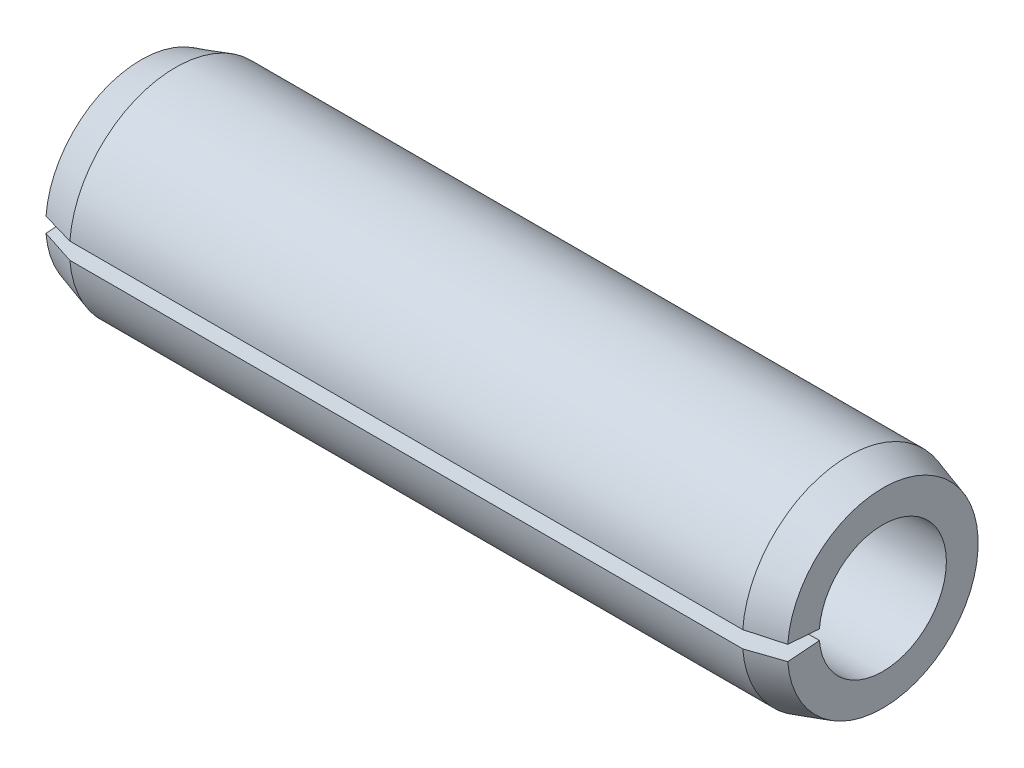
ISO-10303-21;
HEADER;
FILE_DESCRIPTION(('STEP AP214'),'2;1');
FILE_NAME('part.step','',(''),(''),'','','');
FILE_SCHEMA(('AUTOMOTIVE_DESIGN { 1 0 10303 214 1 1 1 1 }'));
ENDSEC;
DATA;
#1=APPLICATION_CONTEXT('core data for automotive mechanical design processes');
#2=APPLICATION_PROTOCOL_DEFINITION('international standard','automotive_design',2000,#1);
#3=PRODUCT_CONTEXT('',#1,'mechanical');
#4=PRODUCT('Part','Part','',(#3));
#5=PRODUCT_RELATED_PRODUCT_CATEGORY('part','',(#4));
#6=PRODUCT_DEFINITION_FORMATION('','',#4);
#7=PRODUCT_DEFINITION_CONTEXT('part definition',#1,'design');
#8=PRODUCT_DEFINITION('design','',#6,#7);
#9=PRODUCT_DEFINITION_SHAPE('','',#8);
#10=(LENGTH_UNIT() NAMED_UNIT(*) SI_UNIT(.MILLI.,.METRE.));
#11=(NAMED_UNIT(*) PLANE_ANGLE_UNIT() SI_UNIT($,.RADIAN.));
#12=(NAMED_UNIT(*) SI_UNIT($,.STERADIAN.) SOLID_ANGLE_UNIT());
#13=UNCERTAINTY_MEASURE_WITH_UNIT(LENGTH_MEASURE(1.E-05),#10,'distance_accuracy_value','');
#14=(GEOMETRIC_REPRESENTATION_CONTEXT(3) GLOBAL_UNCERTAINTY_ASSIGNED_CONTEXT((#13)) GLOBAL_UNIT_ASSIGNED_CONTEXT((#10,
#11,#12)) REPRESENTATION_CONTEXT('',''));
#15=CARTESIAN_POINT('',(0.,0.,0.));
#16=DIRECTION('',(0.,0.,1.));
#17=DIRECTION('',(1.,0.,0.));
#18=AXIS2_PLACEMENT_3D('',#15,#16,#17);
#19=CARTESIAN_POINT('',(0.,1.8,0.));
#20=DIRECTION('',(1.,0.,0.));
#21=DIRECTION('',(0.,0.,-1.));
#22=AXIS2_PLACEMENT_3D('',#19,#20,#21);
#23=PLANE('',#22);
#24=DIRECTION('',(0.,0.0784590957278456,0.996917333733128));
#25=VECTOR('',#24,1.);
#26=CARTESIAN_POINT('',(0.,0.,0.));
#27=LINE('',#26,#25);
#28=CARTESIAN_POINT('',(0.,0.0941509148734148,1.19630080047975));
#29=VERTEX_POINT('',#28);
#30=CARTESIAN_POINT('',(0.,0.141226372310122,1.79445120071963));
#31=VERTEX_POINT('',#30);
#32=EDGE_CURVE('E81',#29,#31,#27,.T.);
#33=ORIENTED_EDGE('',*,*,#32,.T.);
#34=CARTESIAN_POINT('',(0.,0.,0.));
#35=DIRECTION('',(-1.,0.,0.));
#36=DIRECTION('',(0.,0.,1.));
#37=AXIS2_PLACEMENT_3D('',#34,#35,#36);
#38=CIRCLE('',#37,1.8);
#39=CARTESIAN_POINT('',(0.,-0.141226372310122,1.79445120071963));
#40=VERTEX_POINT('',#39);
#41=EDGE_CURVE('E99',#31,#40,#38,.T.);
#42=ORIENTED_EDGE('',*,*,#41,.T.);
#43=DIRECTION('',(0.,-0.0784590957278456,0.996917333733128));
#44=VECTOR('',#43,1.);
#45=CARTESIAN_POINT('',(0.,0.,0.));
#46=LINE('',#45,#44);
#47=CARTESIAN_POINT('',(0.,-0.0941509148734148,1.19630080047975));
#48=VERTEX_POINT('',#47);
#49=EDGE_CURVE('E53',#48,#40,#46,.T.);
#50=ORIENTED_EDGE('',*,*,#49,.F.);
#51=CARTESIAN_POINT('',(0.,0.,0.));
#52=DIRECTION('',(-1.,0.,0.));
#53=DIRECTION('',(0.,0.,1.));
#54=AXIS2_PLACEMENT_3D('',#51,#52,#53);
#55=CIRCLE('',#54,1.2);
#56=EDGE_CURVE('E96',#29,#48,#55,.T.);
#57=ORIENTED_EDGE('',*,*,#56,.F.);
#58=EDGE_LOOP('',(#33,#42,#50,#57));
#59=FACE_BOUND('',#58,.T.);
#60=ADVANCED_FACE('F32',(#59),#23,.F.);
#61=CARTESIAN_POINT('',(-9.52499999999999,0.,0.));
#62=DIRECTION('',(-1.,0.,0.));
#63=DIRECTION('',(0.,0.,1.));
#64=AXIS2_PLACEMENT_3D('',#61,#62,#63);
#65=CYLINDRICAL_SURFACE('',#64,1.2);
#66=DIRECTION('',(-1.,0.,0.));
#67=VECTOR('',#66,1.);
#68=CARTESIAN_POINT('',(-9.52499999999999,0.0941509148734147,1.19630080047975));
#69=LINE('',#68,#67);
#70=CARTESIAN_POINT('',(14.,0.0941509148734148,1.19630080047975));
#71=VERTEX_POINT('',#70);
#72=EDGE_CURVE('E84',#29,#71,#69,.F.);
#73=ORIENTED_EDGE('',*,*,#72,.F.);
#74=ORIENTED_EDGE('',*,*,#56,.T.);
#75=DIRECTION('',(-1.,0.,0.));
#76=VECTOR('',#75,1.);
#77=CARTESIAN_POINT('',(-9.52499999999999,-0.0941509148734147,1.19630080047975));
#78=LINE('',#77,#76);
#79=CARTESIAN_POINT('',(14.,-0.0941509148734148,1.19630080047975));
#80=VERTEX_POINT('',#79);
#81=EDGE_CURVE('E117',#48,#80,#78,.F.);
#82=ORIENTED_EDGE('',*,*,#81,.T.);
#83=CARTESIAN_POINT('',(14.,0.,0.));
#84=DIRECTION('',(-1.,0.,0.));
#85=DIRECTION('',(0.,0.,1.));
#86=AXIS2_PLACEMENT_3D('',#83,#84,#85);
#87=CIRCLE('',#86,1.2);
#88=EDGE_CURVE('E98',#71,#80,#87,.T.);
#89=ORIENTED_EDGE('',*,*,#88,.F.);
#90=EDGE_LOOP('',(#73,#74,#82,#89));
#91=FACE_BOUND('',#90,.T.);
#92=ADVANCED_FACE('F94',(#91),#65,.F.);
#93=CARTESIAN_POINT('',(14.,1.2,0.));
#94=DIRECTION('',(-1.,0.,0.));
#95=DIRECTION('',(0.,0.,1.));
#96=AXIS2_PLACEMENT_3D('',#93,#94,#95);
#97=PLANE('',#96);
#98=DIRECTION('',(0.,0.0784590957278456,0.996917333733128));
#99=VECTOR('',#98,1.);
#100=CARTESIAN_POINT('',(14.,0.,0.));
#101=LINE('',#100,#99);
#102=CARTESIAN_POINT('',(14.,0.141226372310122,1.79445120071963));
#103=VERTEX_POINT('',#102);
#104=EDGE_CURVE('E126',#71,#103,#101,.T.);
#105=ORIENTED_EDGE('',*,*,#104,.F.);
#106=ORIENTED_EDGE('',*,*,#88,.T.);
#107=DIRECTION('',(0.,-0.0784590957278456,0.996917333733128));
#108=VECTOR('',#107,1.);
#109=CARTESIAN_POINT('',(14.,0.,0.));
#110=LINE('',#109,#108);
#111=CARTESIAN_POINT('',(14.,-0.141226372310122,1.79445120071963));
#112=VERTEX_POINT('',#111);
#113=EDGE_CURVE('E125',#80,#112,#110,.T.);
#114=ORIENTED_EDGE('',*,*,#113,.T.);
#115=CARTESIAN_POINT('',(14.,0.,0.));
#116=DIRECTION('',(-1.,0.,0.));
#117=DIRECTION('',(0.,0.,1.));
#118=AXIS2_PLACEMENT_3D('',#115,#116,#117);
#119=CIRCLE('',#118,1.8);
#120=EDGE_CURVE('E103',#103,#112,#119,.T.);
#121=ORIENTED_EDGE('',*,*,#120,.F.);
#122=EDGE_LOOP('',(#105,#106,#114,#121));
#123=FACE_BOUND('',#122,.T.);
#124=ADVANCED_FACE('F136',(#123),#97,.F.);
#125=CARTESIAN_POINT('',(14.,0.,0.));
#126=DIRECTION('',(-1.,0.,0.));
#127=DIRECTION('',(0.,0.,1.));
#128=AXIS2_PLACEMENT_3D('',#125,#126,#127);
#129=CONICAL_SURFACE('',#128,1.8,0.298498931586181);
#130=DIRECTION('',(-0.95577900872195,0.0230737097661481,0.293179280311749));
#131=VECTOR('',#130,1.);
#132=CARTESIAN_POINT('',(19.85,0.,0.));
#133=LINE('',#132,#131);
#134=CARTESIAN_POINT('',(13.35,0.156918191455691,1.99383466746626));
#135=VERTEX_POINT('',#134);
#136=EDGE_CURVE('E100',#103,#135,#133,.T.);
#137=ORIENTED_EDGE('',*,*,#136,.F.);
#138=ORIENTED_EDGE('',*,*,#120,.T.);
#139=DIRECTION('',(-0.95577900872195,-0.0230737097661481,0.293179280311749));
#140=VECTOR('',#139,1.);
#141=CARTESIAN_POINT('',(19.85,0.,0.));
#142=LINE('',#141,#140);
#143=CARTESIAN_POINT('',(13.35,-0.156918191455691,1.99383466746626));
#144=VERTEX_POINT('',#143);
#145=EDGE_CURVE('E119',#112,#144,#142,.T.);
#146=ORIENTED_EDGE('',*,*,#145,.T.);
#147=CARTESIAN_POINT('',(13.35,0.,0.));
#148=DIRECTION('',(-1.,0.,0.));
#149=DIRECTION('',(0.,0.,1.));
#150=AXIS2_PLACEMENT_3D('',#147,#148,#149);
#151=CIRCLE('',#150,2.);
#152=EDGE_CURVE('E108',#135,#144,#151,.T.);
#153=ORIENTED_EDGE('',*,*,#152,.F.);
#154=EDGE_LOOP('',(#137,#138,#146,#153));
#155=FACE_BOUND('',#154,.T.);
#156=ADVANCED_FACE('F135',(#155),#129,.T.);
#157=CARTESIAN_POINT('',(-9.52499999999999,0.,0.));
#158=DIRECTION('',(-1.,0.,0.));
#159=DIRECTION('',(0.,0.,1.));
#160=AXIS2_PLACEMENT_3D('',#157,#158,#159);
#161=CYLINDRICAL_SURFACE('',#160,2.);
#162=DIRECTION('',(-1.,0.,0.));
#163=VECTOR('',#162,1.);
#164=CARTESIAN_POINT('',(-9.52499999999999,0.156918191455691,1.99383466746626));
#165=LINE('',#164,#163);
#166=CARTESIAN_POINT('',(0.65,0.156918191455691,1.99383466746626));
#167=VERTEX_POINT('',#166);
#168=EDGE_CURVE('E45',#135,#167,#165,.T.);
#169=ORIENTED_EDGE('',*,*,#168,.F.);
#170=ORIENTED_EDGE('',*,*,#152,.T.);
#171=DIRECTION('',(-1.,0.,0.));
#172=VECTOR('',#171,1.);
#173=CARTESIAN_POINT('',(-9.52499999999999,-0.156918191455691,1.99383466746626));
#174=LINE('',#173,#172);
#175=CARTESIAN_POINT('',(0.649999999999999,-0.156918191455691,1.99383466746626));
#176=VERTEX_POINT('',#175);
#177=EDGE_CURVE('E122',#144,#176,#174,.T.);
#178=ORIENTED_EDGE('',*,*,#177,.T.);
#179=CARTESIAN_POINT('',(0.65,0.,0.));
#180=DIRECTION('',(-1.,0.,0.));
#181=DIRECTION('',(0.,0.,1.));
#182=AXIS2_PLACEMENT_3D('',#179,#180,#181);
#183=CIRCLE('',#182,2.);
#184=EDGE_CURVE('E111',#167,#176,#183,.T.);
#185=ORIENTED_EDGE('',*,*,#184,.F.);
#186=EDGE_LOOP('',(#169,#170,#178,#185));
#187=FACE_BOUND('',#186,.T.);
#188=ADVANCED_FACE('F139',(#187),#161,.T.);
#189=CARTESIAN_POINT('',(0.65,0.,0.));
#190=DIRECTION('',(1.,0.,0.));
#191=DIRECTION('',(0.,0.,-1.));
#192=AXIS2_PLACEMENT_3D('',#189,#190,#191);
#193=CONICAL_SURFACE('',#192,2.,0.29849893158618);
#194=DIRECTION('',(-0.95577900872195,-0.023073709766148,-0.293179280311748));
#195=VECTOR('',#194,1.);
#196=CARTESIAN_POINT('',(-5.84999999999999,0.,0.));
#197=LINE('',#196,#195);
#198=EDGE_CURVE('E11',#167,#31,#197,.T.);
#199=ORIENTED_EDGE('',*,*,#198,.F.);
#200=ORIENTED_EDGE('',*,*,#184,.T.);
#201=DIRECTION('',(-0.95577900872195,0.023073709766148,-0.293179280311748));
#202=VECTOR('',#201,1.);
#203=CARTESIAN_POINT('',(-5.84999999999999,0.,0.));
#204=LINE('',#203,#202);
#205=EDGE_CURVE('E39',#176,#40,#204,.T.);
#206=ORIENTED_EDGE('',*,*,#205,.T.);
#207=ORIENTED_EDGE('',*,*,#41,.F.);
#208=EDGE_LOOP('',(#199,#200,#206,#207));
#209=FACE_BOUND('',#208,.T.);
#210=ADVANCED_FACE('F142',(#209),#193,.T.);
#211=CARTESIAN_POINT('',(14.,0.,0.));
#212=DIRECTION('',(0.,-0.996917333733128,-0.0784590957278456));
#213=DIRECTION('',(0.,0.0784590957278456,-0.996917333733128));
#214=AXIS2_PLACEMENT_3D('',#211,#212,#213);
#215=PLANE('',#214);
#216=ORIENTED_EDGE('',*,*,#49,.T.);
#217=ORIENTED_EDGE('',*,*,#205,.F.);
#218=ORIENTED_EDGE('',*,*,#177,.F.);
#219=ORIENTED_EDGE('',*,*,#145,.F.);
#220=ORIENTED_EDGE('',*,*,#113,.F.);
#221=ORIENTED_EDGE('',*,*,#81,.F.);
#222=EDGE_LOOP('',(#216,#217,#218,#219,#220,#221));
#223=FACE_BOUND('',#222,.T.);
#224=ADVANCED_FACE('F137',(#223),#215,.F.);
#225=CARTESIAN_POINT('',(14.,0.,0.));
#226=DIRECTION('',(0.,-0.996917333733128,0.0784590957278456));
#227=DIRECTION('',(0.,-0.0784590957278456,-0.996917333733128));
#228=AXIS2_PLACEMENT_3D('',#225,#226,#227);
#229=PLANE('',#228);
#230=ORIENTED_EDGE('',*,*,#72,.T.);
#231=ORIENTED_EDGE('',*,*,#104,.T.);
#232=ORIENTED_EDGE('',*,*,#136,.T.);
#233=ORIENTED_EDGE('',*,*,#168,.T.);
#234=ORIENTED_EDGE('',*,*,#198,.T.);
#235=ORIENTED_EDGE('',*,*,#32,.F.);
#236=EDGE_LOOP('',(#230,#231,#232,#233,#234,#235));
#237=FACE_BOUND('',#236,.T.);
#238=ADVANCED_FACE('F83',(#237),#229,.T.);
#239=CLOSED_SHELL('',(#60,#92,#124,#156,#188,#210,#224,#238));
#240=MANIFOLD_SOLID_BREP('B2',#239);
#241=ADVANCED_BREP_SHAPE_REPRESENTATION('',(#18,#240),#14);
#242=SHAPE_DEFINITION_REPRESENTATION(#9,#241);
ENDSEC;
END-ISO-10303-21;
